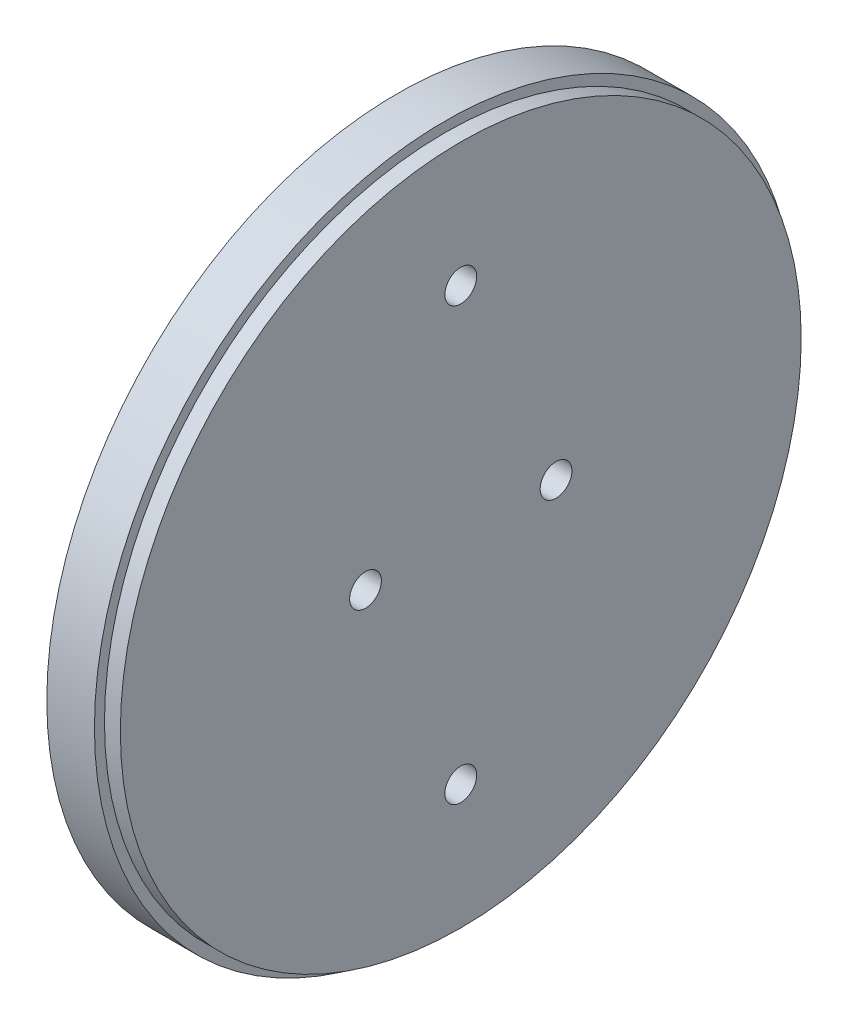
from build123d import *

# Parameters (mm, degrees)
SKETCH1_R               = 70.0786
BOSS_EXTRUDE1_DEPTH     = 9.525
SKETCH3_R               = 68.072
BOSS_EXTRUDE2_DEPTH     = 3.175
CUT_EXTRUDE1_DEPTH      = 100.562774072
CUT_EXTRUDE1_DEPTH_BACK = 100.562774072
SKETCH2_R               = 3.175


with BuildPart() as part:
    # Sketch1 → Boss-Extrude1 (new body)
    with BuildSketch(Plane(origin=(0, 0, 0), x_dir=(0, 0, -1), z_dir=(1, 0, 0))):
        with Locations(Location((0, 0, 0), (0, 0, 180))):
            Circle(SKETCH1_R)
    extrude(amount=BOSS_EXTRUDE1_DEPTH)

    # Sketch3 → Boss-Extrude2 (add)
    with BuildSketch(Plane(origin=(9.525, 0, 0), x_dir=(0, 0, -1), z_dir=(1, 0, 0))):
        Circle(SKETCH3_R)
    extrude(amount=BOSS_EXTRUDE2_DEPTH)

    # Sketch2 → Cut-Extrude1 (cut, two sides: drawn at the far end of the back side and taken through both)
    with BuildSketch(Plane(origin=(9.525, 0, 0), x_dir=(0, 0, -1), z_dir=(1, 0, 0)).offset(-CUT_EXTRUDE1_DEPTH_BACK)):
        with Locations((19.05, 0)):
            Circle(SKETCH2_R)
        with Locations((-19.05, 0)):
            Circle(SKETCH2_R)
        with Locations((0, 43.18)):
            Circle(SKETCH2_R)
        with Locations((0, -43.18)):
            Circle(SKETCH2_R)
    extrude(amount=CUT_EXTRUDE1_DEPTH + CUT_EXTRUDE1_DEPTH_BACK, mode=Mode.SUBTRACT)


solid = part.part
